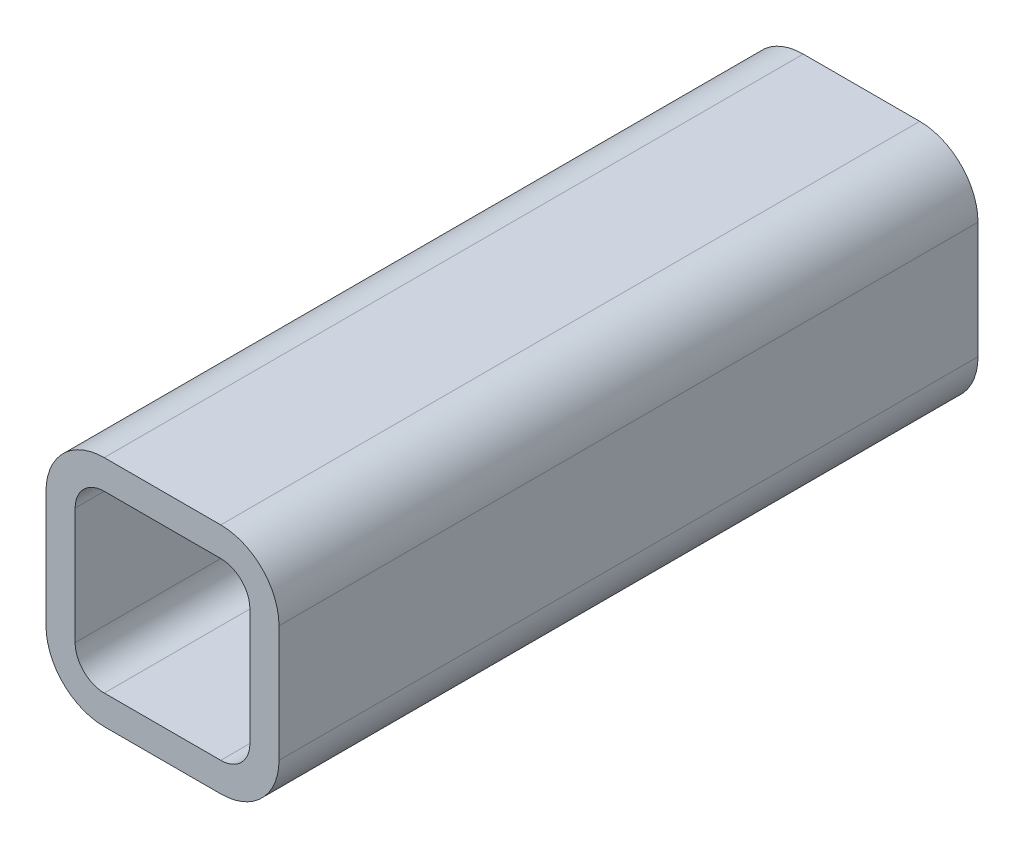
ISO-10303-21;
HEADER;
FILE_DESCRIPTION(('STEP AP214'),'2;1');
FILE_NAME('part.step','',(''),(''),'','','');
FILE_SCHEMA(('AUTOMOTIVE_DESIGN { 1 0 10303 214 1 1 1 1 }'));
ENDSEC;
DATA;
#1=APPLICATION_CONTEXT('core data for automotive mechanical design processes');
#2=APPLICATION_PROTOCOL_DEFINITION('international standard','automotive_design',2000,#1);
#3=PRODUCT_CONTEXT('',#1,'mechanical');
#4=PRODUCT('Part','Part','',(#3));
#5=PRODUCT_RELATED_PRODUCT_CATEGORY('part','',(#4));
#6=PRODUCT_DEFINITION_FORMATION('','',#4);
#7=PRODUCT_DEFINITION_CONTEXT('part definition',#1,'design');
#8=PRODUCT_DEFINITION('design','',#6,#7);
#9=PRODUCT_DEFINITION_SHAPE('','',#8);
#10=(LENGTH_UNIT() NAMED_UNIT(*) SI_UNIT(.MILLI.,.METRE.));
#11=(NAMED_UNIT(*) PLANE_ANGLE_UNIT() SI_UNIT($,.RADIAN.));
#12=(NAMED_UNIT(*) SI_UNIT($,.STERADIAN.) SOLID_ANGLE_UNIT());
#13=UNCERTAINTY_MEASURE_WITH_UNIT(LENGTH_MEASURE(1.E-05),#10,'distance_accuracy_value','');
#14=(GEOMETRIC_REPRESENTATION_CONTEXT(3) GLOBAL_UNCERTAINTY_ASSIGNED_CONTEXT((#13)) GLOBAL_UNIT_ASSIGNED_CONTEXT((#10,
#11,#12)) REPRESENTATION_CONTEXT('',''));
#15=CARTESIAN_POINT('',(0.,0.,0.));
#16=DIRECTION('',(0.,0.,1.));
#17=DIRECTION('',(1.,0.,0.));
#18=AXIS2_PLACEMENT_3D('',#15,#16,#17);
#19=CARTESIAN_POINT('',(27.0751778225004,78.2577651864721,304.8));
#20=DIRECTION('',(0.,0.,1.));
#21=DIRECTION('',(1.,0.,0.));
#22=AXIS2_PLACEMENT_3D('',#19,#20,#21);
#23=PLANE('',#22);
#24=CARTESIAN_POINT('',(27.0751778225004,78.2577651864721,304.8));
#25=DIRECTION('',(0.,0.,1.));
#26=DIRECTION('',(1.,0.,0.));
#27=AXIS2_PLACEMENT_3D('',#24,#25,#26);
#28=CIRCLE('',#27,25.4);
#29=CARTESIAN_POINT('',(27.0751778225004,103.657765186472,304.8));
#30=VERTEX_POINT('',#29);
#31=CARTESIAN_POINT('',(1.67517782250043,78.2577651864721,304.8));
#32=VERTEX_POINT('',#31);
#33=EDGE_CURVE('E211',#30,#32,#28,.T.);
#34=ORIENTED_EDGE('',*,*,#33,.T.);
#35=DIRECTION('',(0.,-1.,0.));
#36=VECTOR('',#35,1.);
#37=CARTESIAN_POINT('',(1.67517782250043,78.2577651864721,304.8));
#38=LINE('',#37,#36);
#39=CARTESIAN_POINT('',(1.67517782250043,27.4577651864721,304.8));
#40=VERTEX_POINT('',#39);
#41=EDGE_CURVE('E214',#32,#40,#38,.T.);
#42=ORIENTED_EDGE('',*,*,#41,.T.);
#43=CARTESIAN_POINT('',(27.0751778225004,27.4577651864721,304.8));
#44=DIRECTION('',(0.,0.,1.));
#45=DIRECTION('',(1.,0.,0.));
#46=AXIS2_PLACEMENT_3D('',#43,#44,#45);
#47=CIRCLE('',#46,25.4);
#48=CARTESIAN_POINT('',(27.0751778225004,2.05776518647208,304.8));
#49=VERTEX_POINT('',#48);
#50=EDGE_CURVE('E217',#40,#49,#47,.T.);
#51=ORIENTED_EDGE('',*,*,#50,.T.);
#52=DIRECTION('',(1.,0.,0.));
#53=VECTOR('',#52,1.);
#54=CARTESIAN_POINT('',(27.0751778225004,2.05776518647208,304.8));
#55=LINE('',#54,#53);
#56=CARTESIAN_POINT('',(77.8751778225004,2.05776518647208,304.8));
#57=VERTEX_POINT('',#56);
#58=EDGE_CURVE('E219',#49,#57,#55,.T.);
#59=ORIENTED_EDGE('',*,*,#58,.T.);
#60=CARTESIAN_POINT('',(77.8751778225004,27.4577651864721,304.8));
#61=DIRECTION('',(0.,0.,1.));
#62=DIRECTION('',(1.,0.,0.));
#63=AXIS2_PLACEMENT_3D('',#60,#61,#62);
#64=CIRCLE('',#63,25.4);
#65=CARTESIAN_POINT('',(103.2751778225,27.4577651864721,304.8));
#66=VERTEX_POINT('',#65);
#67=EDGE_CURVE('E221',#57,#66,#64,.T.);
#68=ORIENTED_EDGE('',*,*,#67,.T.);
#69=DIRECTION('',(0.,1.,0.));
#70=VECTOR('',#69,1.);
#71=CARTESIAN_POINT('',(103.2751778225,27.4577651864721,304.8));
#72=LINE('',#71,#70);
#73=CARTESIAN_POINT('',(103.2751778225,78.2577651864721,304.8));
#74=VERTEX_POINT('',#73);
#75=EDGE_CURVE('E223',#66,#74,#72,.T.);
#76=ORIENTED_EDGE('',*,*,#75,.T.);
#77=CARTESIAN_POINT('',(77.8751778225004,78.2577651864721,304.8));
#78=DIRECTION('',(0.,0.,1.));
#79=DIRECTION('',(1.,0.,0.));
#80=AXIS2_PLACEMENT_3D('',#77,#78,#79);
#81=CIRCLE('',#80,25.4);
#82=CARTESIAN_POINT('',(77.8751778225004,103.657765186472,304.8));
#83=VERTEX_POINT('',#82);
#84=EDGE_CURVE('E225',#74,#83,#81,.T.);
#85=ORIENTED_EDGE('',*,*,#84,.T.);
#86=DIRECTION('',(-1.,0.,0.));
#87=VECTOR('',#86,1.);
#88=CARTESIAN_POINT('',(77.8751778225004,103.657765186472,304.8));
#89=LINE('',#88,#87);
#90=EDGE_CURVE('E227',#83,#30,#89,.T.);
#91=ORIENTED_EDGE('',*,*,#90,.T.);
#92=EDGE_LOOP('',(#34,#42,#51,#59,#68,#76,#85,#91));
#93=FACE_BOUND('',#92,.T.);
#94=DIRECTION('',(0.,-1.,0.));
#95=VECTOR('',#94,1.);
#96=CARTESIAN_POINT('',(14.3751778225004,27.4577651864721,304.8));
#97=LINE('',#96,#95);
#98=CARTESIAN_POINT('',(14.3751778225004,78.2577651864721,304.8));
#99=VERTEX_POINT('',#98);
#100=CARTESIAN_POINT('',(14.3751778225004,27.4577651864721,304.8));
#101=VERTEX_POINT('',#100);
#102=EDGE_CURVE('E154',#99,#101,#97,.T.);
#103=ORIENTED_EDGE('',*,*,#102,.F.);
#104=CARTESIAN_POINT('',(27.0751778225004,78.2577651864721,304.8));
#105=DIRECTION('',(0.,0.,1.));
#106=DIRECTION('',(1.,0.,0.));
#107=AXIS2_PLACEMENT_3D('',#104,#105,#106);
#108=CIRCLE('',#107,12.7);
#109=CARTESIAN_POINT('',(27.0751778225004,90.9577651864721,304.8));
#110=VERTEX_POINT('',#109);
#111=EDGE_CURVE('E146',#110,#99,#108,.T.);
#112=ORIENTED_EDGE('',*,*,#111,.F.);
#113=DIRECTION('',(-1.,0.,0.));
#114=VECTOR('',#113,1.);
#115=CARTESIAN_POINT('',(27.0751778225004,90.9577651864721,304.8));
#116=LINE('',#115,#114);
#117=CARTESIAN_POINT('',(77.8751778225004,90.9577651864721,304.8));
#118=VERTEX_POINT('',#117);
#119=EDGE_CURVE('E179',#118,#110,#116,.T.);
#120=ORIENTED_EDGE('',*,*,#119,.F.);
#121=CARTESIAN_POINT('',(77.8751778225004,78.2577651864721,304.8));
#122=DIRECTION('',(0.,0.,1.));
#123=DIRECTION('',(1.,0.,0.));
#124=AXIS2_PLACEMENT_3D('',#121,#122,#123);
#125=CIRCLE('',#124,12.7);
#126=CARTESIAN_POINT('',(90.5751778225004,78.2577651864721,304.8));
#127=VERTEX_POINT('',#126);
#128=EDGE_CURVE('E177',#127,#118,#125,.T.);
#129=ORIENTED_EDGE('',*,*,#128,.F.);
#130=DIRECTION('',(0.,1.,0.));
#131=VECTOR('',#130,1.);
#132=CARTESIAN_POINT('',(90.5751778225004,78.2577651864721,304.8));
#133=LINE('',#132,#131);
#134=CARTESIAN_POINT('',(90.5751778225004,27.4577651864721,304.8));
#135=VERTEX_POINT('',#134);
#136=EDGE_CURVE('E175',#135,#127,#133,.T.);
#137=ORIENTED_EDGE('',*,*,#136,.F.);
#138=CARTESIAN_POINT('',(77.8751778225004,27.4577651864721,304.8));
#139=DIRECTION('',(0.,0.,1.));
#140=DIRECTION('',(1.,0.,0.));
#141=AXIS2_PLACEMENT_3D('',#138,#139,#140);
#142=CIRCLE('',#141,12.7);
#143=CARTESIAN_POINT('',(77.8751778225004,14.7577651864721,304.8));
#144=VERTEX_POINT('',#143);
#145=EDGE_CURVE('E173',#144,#135,#142,.T.);
#146=ORIENTED_EDGE('',*,*,#145,.F.);
#147=DIRECTION('',(1.,0.,0.));
#148=VECTOR('',#147,1.);
#149=CARTESIAN_POINT('',(77.8751778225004,14.7577651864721,304.8));
#150=LINE('',#149,#148);
#151=CARTESIAN_POINT('',(27.0751778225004,14.7577651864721,304.8));
#152=VERTEX_POINT('',#151);
#153=EDGE_CURVE('E169',#152,#144,#150,.T.);
#154=ORIENTED_EDGE('',*,*,#153,.F.);
#155=CARTESIAN_POINT('',(27.0751778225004,27.4577651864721,304.8));
#156=DIRECTION('',(0.,0.,1.));
#157=DIRECTION('',(1.,0.,0.));
#158=AXIS2_PLACEMENT_3D('',#155,#156,#157);
#159=CIRCLE('',#158,12.7);
#160=EDGE_CURVE('E167',#101,#152,#159,.T.);
#161=ORIENTED_EDGE('',*,*,#160,.F.);
#162=EDGE_LOOP('',(#103,#112,#120,#129,#137,#146,#154,#161));
#163=FACE_BOUND('',#162,.T.);
#164=ADVANCED_FACE('F33',(#93,#163),#23,.T.);
#165=CARTESIAN_POINT('',(27.0751778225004,78.2577651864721,0.));
#166=DIRECTION('',(0.,0.,1.));
#167=DIRECTION('',(1.,0.,0.));
#168=AXIS2_PLACEMENT_3D('',#165,#166,#167);
#169=PLANE('',#168);
#170=CARTESIAN_POINT('',(27.0751778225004,78.2577651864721,0.));
#171=DIRECTION('',(0.,0.,1.));
#172=DIRECTION('',(1.,0.,0.));
#173=AXIS2_PLACEMENT_3D('',#170,#171,#172);
#174=CIRCLE('',#173,25.4);
#175=CARTESIAN_POINT('',(27.0751778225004,103.657765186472,0.));
#176=VERTEX_POINT('',#175);
#177=CARTESIAN_POINT('',(1.67517782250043,78.2577651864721,0.));
#178=VERTEX_POINT('',#177);
#179=EDGE_CURVE('E162',#176,#178,#174,.T.);
#180=ORIENTED_EDGE('',*,*,#179,.F.);
#181=DIRECTION('',(-1.,0.,0.));
#182=VECTOR('',#181,1.);
#183=CARTESIAN_POINT('',(77.8751778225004,103.657765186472,0.));
#184=LINE('',#183,#182);
#185=CARTESIAN_POINT('',(77.8751778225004,103.657765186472,0.));
#186=VERTEX_POINT('',#185);
#187=EDGE_CURVE('E215',#186,#176,#184,.T.);
#188=ORIENTED_EDGE('',*,*,#187,.F.);
#189=CARTESIAN_POINT('',(77.8751778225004,78.2577651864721,0.));
#190=DIRECTION('',(0.,0.,1.));
#191=DIRECTION('',(1.,0.,0.));
#192=AXIS2_PLACEMENT_3D('',#189,#190,#191);
#193=CIRCLE('',#192,25.4);
#194=CARTESIAN_POINT('',(103.2751778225,78.2577651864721,0.));
#195=VERTEX_POINT('',#194);
#196=EDGE_CURVE('E242',#195,#186,#193,.T.);
#197=ORIENTED_EDGE('',*,*,#196,.F.);
#198=DIRECTION('',(0.,1.,0.));
#199=VECTOR('',#198,1.);
#200=CARTESIAN_POINT('',(103.2751778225,27.4577651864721,0.));
#201=LINE('',#200,#199);
#202=CARTESIAN_POINT('',(103.2751778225,27.4577651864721,0.));
#203=VERTEX_POINT('',#202);
#204=EDGE_CURVE('E240',#203,#195,#201,.T.);
#205=ORIENTED_EDGE('',*,*,#204,.F.);
#206=CARTESIAN_POINT('',(77.8751778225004,27.4577651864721,0.));
#207=DIRECTION('',(0.,0.,1.));
#208=DIRECTION('',(1.,0.,0.));
#209=AXIS2_PLACEMENT_3D('',#206,#207,#208);
#210=CIRCLE('',#209,25.4);
#211=CARTESIAN_POINT('',(77.8751778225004,2.05776518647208,0.));
#212=VERTEX_POINT('',#211);
#213=EDGE_CURVE('E238',#212,#203,#210,.T.);
#214=ORIENTED_EDGE('',*,*,#213,.F.);
#215=DIRECTION('',(1.,0.,0.));
#216=VECTOR('',#215,1.);
#217=CARTESIAN_POINT('',(27.0751778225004,2.05776518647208,0.));
#218=LINE('',#217,#216);
#219=CARTESIAN_POINT('',(27.0751778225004,2.05776518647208,0.));
#220=VERTEX_POINT('',#219);
#221=EDGE_CURVE('E236',#220,#212,#218,.T.);
#222=ORIENTED_EDGE('',*,*,#221,.F.);
#223=CARTESIAN_POINT('',(27.0751778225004,27.4577651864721,0.));
#224=DIRECTION('',(0.,0.,1.));
#225=DIRECTION('',(1.,0.,0.));
#226=AXIS2_PLACEMENT_3D('',#223,#224,#225);
#227=CIRCLE('',#226,25.4);
#228=CARTESIAN_POINT('',(1.67517782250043,27.4577651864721,0.));
#229=VERTEX_POINT('',#228);
#230=EDGE_CURVE('E234',#229,#220,#227,.T.);
#231=ORIENTED_EDGE('',*,*,#230,.F.);
#232=DIRECTION('',(0.,-1.,0.));
#233=VECTOR('',#232,1.);
#234=CARTESIAN_POINT('',(1.67517782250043,78.2577651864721,0.));
#235=LINE('',#234,#233);
#236=EDGE_CURVE('E232',#178,#229,#235,.T.);
#237=ORIENTED_EDGE('',*,*,#236,.F.);
#238=EDGE_LOOP('',(#180,#188,#197,#205,#214,#222,#231,#237));
#239=FACE_BOUND('',#238,.T.);
#240=CARTESIAN_POINT('',(27.0751778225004,78.2577651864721,0.));
#241=DIRECTION('',(0.,0.,1.));
#242=DIRECTION('',(1.,0.,0.));
#243=AXIS2_PLACEMENT_3D('',#240,#241,#242);
#244=CIRCLE('',#243,12.7);
#245=CARTESIAN_POINT('',(27.0751778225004,90.9577651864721,0.));
#246=VERTEX_POINT('',#245);
#247=CARTESIAN_POINT('',(14.3751778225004,78.2577651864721,0.));
#248=VERTEX_POINT('',#247);
#249=EDGE_CURVE('E56',#246,#248,#244,.T.);
#250=ORIENTED_EDGE('',*,*,#249,.T.);
#251=DIRECTION('',(0.,-1.,0.));
#252=VECTOR('',#251,1.);
#253=CARTESIAN_POINT('',(14.3751778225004,27.4577651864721,0.));
#254=LINE('',#253,#252);
#255=CARTESIAN_POINT('',(14.3751778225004,27.4577651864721,0.));
#256=VERTEX_POINT('',#255);
#257=EDGE_CURVE('E161',#248,#256,#254,.T.);
#258=ORIENTED_EDGE('',*,*,#257,.T.);
#259=CARTESIAN_POINT('',(27.0751778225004,27.4577651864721,0.));
#260=DIRECTION('',(0.,0.,1.));
#261=DIRECTION('',(1.,0.,0.));
#262=AXIS2_PLACEMENT_3D('',#259,#260,#261);
#263=CIRCLE('',#262,12.7);
#264=CARTESIAN_POINT('',(27.0751778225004,14.7577651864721,0.));
#265=VERTEX_POINT('',#264);
#266=EDGE_CURVE('E183',#256,#265,#263,.T.);
#267=ORIENTED_EDGE('',*,*,#266,.T.);
#268=DIRECTION('',(1.,0.,0.));
#269=VECTOR('',#268,1.);
#270=CARTESIAN_POINT('',(77.8751778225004,14.7577651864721,0.));
#271=LINE('',#270,#269);
#272=CARTESIAN_POINT('',(77.8751778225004,14.7577651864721,0.));
#273=VERTEX_POINT('',#272);
#274=EDGE_CURVE('E186',#265,#273,#271,.T.);
#275=ORIENTED_EDGE('',*,*,#274,.T.);
#276=CARTESIAN_POINT('',(77.8751778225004,27.4577651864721,0.));
#277=DIRECTION('',(0.,0.,1.));
#278=DIRECTION('',(1.,0.,0.));
#279=AXIS2_PLACEMENT_3D('',#276,#277,#278);
#280=CIRCLE('',#279,12.7);
#281=CARTESIAN_POINT('',(90.5751778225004,27.4577651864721,0.));
#282=VERTEX_POINT('',#281);
#283=EDGE_CURVE('E189',#273,#282,#280,.T.);
#284=ORIENTED_EDGE('',*,*,#283,.T.);
#285=DIRECTION('',(0.,1.,0.));
#286=VECTOR('',#285,1.);
#287=CARTESIAN_POINT('',(90.5751778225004,78.2577651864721,0.));
#288=LINE('',#287,#286);
#289=CARTESIAN_POINT('',(90.5751778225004,78.2577651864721,0.));
#290=VERTEX_POINT('',#289);
#291=EDGE_CURVE('E192',#282,#290,#288,.T.);
#292=ORIENTED_EDGE('',*,*,#291,.T.);
#293=CARTESIAN_POINT('',(77.8751778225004,78.2577651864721,0.));
#294=DIRECTION('',(0.,0.,1.));
#295=DIRECTION('',(1.,0.,0.));
#296=AXIS2_PLACEMENT_3D('',#293,#294,#295);
#297=CIRCLE('',#296,12.7);
#298=CARTESIAN_POINT('',(77.8751778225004,90.9577651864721,0.));
#299=VERTEX_POINT('',#298);
#300=EDGE_CURVE('E195',#290,#299,#297,.T.);
#301=ORIENTED_EDGE('',*,*,#300,.T.);
#302=DIRECTION('',(-1.,0.,0.));
#303=VECTOR('',#302,1.);
#304=CARTESIAN_POINT('',(27.0751778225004,90.9577651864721,0.));
#305=LINE('',#304,#303);
#306=EDGE_CURVE('E155',#299,#246,#305,.T.);
#307=ORIENTED_EDGE('',*,*,#306,.T.);
#308=EDGE_LOOP('',(#250,#258,#267,#275,#284,#292,#301,#307));
#309=FACE_BOUND('',#308,.T.);
#310=ADVANCED_FACE('F272',(#239,#309),#169,.F.);
#311=CARTESIAN_POINT('',(27.0751778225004,78.2577651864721,304.8));
#312=DIRECTION('',(0.,0.,-1.));
#313=DIRECTION('',(-1.,0.,0.));
#314=AXIS2_PLACEMENT_3D('',#311,#312,#313);
#315=CYLINDRICAL_SURFACE('',#314,25.4);
#316=ORIENTED_EDGE('',*,*,#179,.T.);
#317=DIRECTION('',(0.,0.,-1.));
#318=VECTOR('',#317,1.);
#319=CARTESIAN_POINT('',(1.67517782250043,78.2577651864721,304.8));
#320=LINE('',#319,#318);
#321=EDGE_CURVE('E11',#32,#178,#320,.T.);
#322=ORIENTED_EDGE('',*,*,#321,.F.);
#323=ORIENTED_EDGE('',*,*,#33,.F.);
#324=DIRECTION('',(0.,0.,-1.));
#325=VECTOR('',#324,1.);
#326=CARTESIAN_POINT('',(27.0751778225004,103.657765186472,304.8));
#327=LINE('',#326,#325);
#328=EDGE_CURVE('E229',#30,#176,#327,.T.);
#329=ORIENTED_EDGE('',*,*,#328,.T.);
#330=EDGE_LOOP('',(#316,#322,#323,#329));
#331=FACE_BOUND('',#330,.T.);
#332=ADVANCED_FACE('F35',(#331),#315,.T.);
#333=CARTESIAN_POINT('',(1.67517782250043,78.2577651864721,304.8));
#334=DIRECTION('',(1.,0.,0.));
#335=DIRECTION('',(0.,0.,-1.));
#336=AXIS2_PLACEMENT_3D('',#333,#334,#335);
#337=PLANE('',#336);
#338=ORIENTED_EDGE('',*,*,#236,.T.);
#339=DIRECTION('',(0.,0.,-1.));
#340=VECTOR('',#339,1.);
#341=CARTESIAN_POINT('',(1.67517782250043,27.4577651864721,304.8));
#342=LINE('',#341,#340);
#343=EDGE_CURVE('E41',#40,#229,#342,.T.);
#344=ORIENTED_EDGE('',*,*,#343,.F.);
#345=ORIENTED_EDGE('',*,*,#41,.F.);
#346=ORIENTED_EDGE('',*,*,#321,.T.);
#347=EDGE_LOOP('',(#338,#344,#345,#346));
#348=FACE_BOUND('',#347,.T.);
#349=ADVANCED_FACE('F289',(#348),#337,.F.);
#350=CARTESIAN_POINT('',(27.0751778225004,27.4577651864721,304.8));
#351=DIRECTION('',(0.,0.,-1.));
#352=DIRECTION('',(-1.,0.,0.));
#353=AXIS2_PLACEMENT_3D('',#350,#351,#352);
#354=CYLINDRICAL_SURFACE('',#353,25.4);
#355=ORIENTED_EDGE('',*,*,#230,.T.);
#356=DIRECTION('',(0.,0.,-1.));
#357=VECTOR('',#356,1.);
#358=CARTESIAN_POINT('',(27.0751778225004,2.05776518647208,304.8));
#359=LINE('',#358,#357);
#360=EDGE_CURVE('E259',#49,#220,#359,.T.);
#361=ORIENTED_EDGE('',*,*,#360,.F.);
#362=ORIENTED_EDGE('',*,*,#50,.F.);
#363=ORIENTED_EDGE('',*,*,#343,.T.);
#364=EDGE_LOOP('',(#355,#361,#362,#363));
#365=FACE_BOUND('',#364,.T.);
#366=ADVANCED_FACE('F266',(#365),#354,.T.);
#367=CARTESIAN_POINT('',(27.0751778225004,2.05776518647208,304.8));
#368=DIRECTION('',(0.,1.,0.));
#369=DIRECTION('',(0.,0.,1.));
#370=AXIS2_PLACEMENT_3D('',#367,#368,#369);
#371=PLANE('',#370);
#372=ORIENTED_EDGE('',*,*,#221,.T.);
#373=DIRECTION('',(0.,0.,-1.));
#374=VECTOR('',#373,1.);
#375=CARTESIAN_POINT('',(77.8751778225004,2.05776518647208,304.8));
#376=LINE('',#375,#374);
#377=EDGE_CURVE('E256',#57,#212,#376,.T.);
#378=ORIENTED_EDGE('',*,*,#377,.F.);
#379=ORIENTED_EDGE('',*,*,#58,.F.);
#380=ORIENTED_EDGE('',*,*,#360,.T.);
#381=EDGE_LOOP('',(#372,#378,#379,#380));
#382=FACE_BOUND('',#381,.T.);
#383=ADVANCED_FACE('F278',(#382),#371,.F.);
#384=CARTESIAN_POINT('',(77.8751778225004,27.4577651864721,304.8));
#385=DIRECTION('',(0.,0.,-1.));
#386=DIRECTION('',(-1.,0.,0.));
#387=AXIS2_PLACEMENT_3D('',#384,#385,#386);
#388=CYLINDRICAL_SURFACE('',#387,25.4);
#389=ORIENTED_EDGE('',*,*,#213,.T.);
#390=DIRECTION('',(0.,0.,-1.));
#391=VECTOR('',#390,1.);
#392=CARTESIAN_POINT('',(103.2751778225,27.4577651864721,304.8));
#393=LINE('',#392,#391);
#394=EDGE_CURVE('E253',#66,#203,#393,.T.);
#395=ORIENTED_EDGE('',*,*,#394,.F.);
#396=ORIENTED_EDGE('',*,*,#67,.F.);
#397=ORIENTED_EDGE('',*,*,#377,.T.);
#398=EDGE_LOOP('',(#389,#395,#396,#397));
#399=FACE_BOUND('',#398,.T.);
#400=ADVANCED_FACE('F282',(#399),#388,.T.);
#401=CARTESIAN_POINT('',(103.2751778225,27.4577651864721,304.8));
#402=DIRECTION('',(-1.,0.,0.));
#403=DIRECTION('',(0.,0.,1.));
#404=AXIS2_PLACEMENT_3D('',#401,#402,#403);
#405=PLANE('',#404);
#406=ORIENTED_EDGE('',*,*,#204,.T.);
#407=DIRECTION('',(0.,0.,-1.));
#408=VECTOR('',#407,1.);
#409=CARTESIAN_POINT('',(103.2751778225,78.2577651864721,304.8));
#410=LINE('',#409,#408);
#411=EDGE_CURVE('E250',#74,#195,#410,.T.);
#412=ORIENTED_EDGE('',*,*,#411,.F.);
#413=ORIENTED_EDGE('',*,*,#75,.F.);
#414=ORIENTED_EDGE('',*,*,#394,.T.);
#415=EDGE_LOOP('',(#406,#412,#413,#414));
#416=FACE_BOUND('',#415,.T.);
#417=ADVANCED_FACE('F302',(#416),#405,.F.);
#418=CARTESIAN_POINT('',(77.8751778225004,78.2577651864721,304.8));
#419=DIRECTION('',(0.,0.,-1.));
#420=DIRECTION('',(-1.,0.,0.));
#421=AXIS2_PLACEMENT_3D('',#418,#419,#420);
#422=CYLINDRICAL_SURFACE('',#421,25.4);
#423=ORIENTED_EDGE('',*,*,#196,.T.);
#424=DIRECTION('',(0.,0.,-1.));
#425=VECTOR('',#424,1.);
#426=CARTESIAN_POINT('',(77.8751778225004,103.657765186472,304.8));
#427=LINE('',#426,#425);
#428=EDGE_CURVE('E247',#83,#186,#427,.T.);
#429=ORIENTED_EDGE('',*,*,#428,.F.);
#430=ORIENTED_EDGE('',*,*,#84,.F.);
#431=ORIENTED_EDGE('',*,*,#411,.T.);
#432=EDGE_LOOP('',(#423,#429,#430,#431));
#433=FACE_BOUND('',#432,.T.);
#434=ADVANCED_FACE('F300',(#433),#422,.T.);
#435=CARTESIAN_POINT('',(77.8751778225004,103.657765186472,304.8));
#436=DIRECTION('',(0.,-1.,0.));
#437=DIRECTION('',(0.,0.,-1.));
#438=AXIS2_PLACEMENT_3D('',#435,#436,#437);
#439=PLANE('',#438);
#440=ORIENTED_EDGE('',*,*,#187,.T.);
#441=ORIENTED_EDGE('',*,*,#328,.F.);
#442=ORIENTED_EDGE('',*,*,#90,.F.);
#443=ORIENTED_EDGE('',*,*,#428,.T.);
#444=EDGE_LOOP('',(#440,#441,#442,#443));
#445=FACE_BOUND('',#444,.T.);
#446=ADVANCED_FACE('F295',(#445),#439,.F.);
#447=CARTESIAN_POINT('',(27.0751778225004,78.2577651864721,304.8));
#448=DIRECTION('',(0.,0.,-1.));
#449=DIRECTION('',(-1.,0.,0.));
#450=AXIS2_PLACEMENT_3D('',#447,#448,#449);
#451=CYLINDRICAL_SURFACE('',#450,12.7);
#452=ORIENTED_EDGE('',*,*,#249,.F.);
#453=DIRECTION('',(0.,0.,-1.));
#454=VECTOR('',#453,1.);
#455=CARTESIAN_POINT('',(27.0751778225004,90.9577651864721,304.8));
#456=LINE('',#455,#454);
#457=EDGE_CURVE('E150',#110,#246,#456,.T.);
#458=ORIENTED_EDGE('',*,*,#457,.F.);
#459=ORIENTED_EDGE('',*,*,#111,.T.);
#460=DIRECTION('',(0.,0.,-1.));
#461=VECTOR('',#460,1.);
#462=CARTESIAN_POINT('',(14.3751778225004,78.2577651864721,304.8));
#463=LINE('',#462,#461);
#464=EDGE_CURVE('E149',#99,#248,#463,.T.);
#465=ORIENTED_EDGE('',*,*,#464,.T.);
#466=EDGE_LOOP('',(#452,#458,#459,#465));
#467=FACE_BOUND('',#466,.T.);
#468=ADVANCED_FACE('F148',(#467),#451,.F.);
#469=CARTESIAN_POINT('',(14.3751778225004,27.4577651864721,304.8));
#470=DIRECTION('',(1.,0.,0.));
#471=DIRECTION('',(0.,0.,-1.));
#472=AXIS2_PLACEMENT_3D('',#469,#470,#471);
#473=PLANE('',#472);
#474=ORIENTED_EDGE('',*,*,#257,.F.);
#475=ORIENTED_EDGE('',*,*,#464,.F.);
#476=ORIENTED_EDGE('',*,*,#102,.T.);
#477=DIRECTION('',(0.,0.,-1.));
#478=VECTOR('',#477,1.);
#479=CARTESIAN_POINT('',(14.3751778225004,27.4577651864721,304.8));
#480=LINE('',#479,#478);
#481=EDGE_CURVE('E163',#101,#256,#480,.T.);
#482=ORIENTED_EDGE('',*,*,#481,.T.);
#483=EDGE_LOOP('',(#474,#475,#476,#482));
#484=FACE_BOUND('',#483,.T.);
#485=ADVANCED_FACE('F158',(#484),#473,.T.);
#486=CARTESIAN_POINT('',(27.0751778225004,27.4577651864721,304.8));
#487=DIRECTION('',(0.,0.,-1.));
#488=DIRECTION('',(-1.,0.,0.));
#489=AXIS2_PLACEMENT_3D('',#486,#487,#488);
#490=CYLINDRICAL_SURFACE('',#489,12.7);
#491=ORIENTED_EDGE('',*,*,#266,.F.);
#492=ORIENTED_EDGE('',*,*,#481,.F.);
#493=ORIENTED_EDGE('',*,*,#160,.T.);
#494=DIRECTION('',(0.,0.,-1.));
#495=VECTOR('',#494,1.);
#496=CARTESIAN_POINT('',(27.0751778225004,14.7577651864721,304.8));
#497=LINE('',#496,#495);
#498=EDGE_CURVE('E208',#152,#265,#497,.T.);
#499=ORIENTED_EDGE('',*,*,#498,.T.);
#500=EDGE_LOOP('',(#491,#492,#493,#499));
#501=FACE_BOUND('',#500,.T.);
#502=ADVANCED_FACE('F327',(#501),#490,.F.);
#503=CARTESIAN_POINT('',(77.8751778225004,14.7577651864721,304.8));
#504=DIRECTION('',(0.,1.,0.));
#505=DIRECTION('',(0.,0.,1.));
#506=AXIS2_PLACEMENT_3D('',#503,#504,#505);
#507=PLANE('',#506);
#508=ORIENTED_EDGE('',*,*,#274,.F.);
#509=ORIENTED_EDGE('',*,*,#498,.F.);
#510=ORIENTED_EDGE('',*,*,#153,.T.);
#511=DIRECTION('',(0.,0.,-1.));
#512=VECTOR('',#511,1.);
#513=CARTESIAN_POINT('',(77.8751778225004,14.7577651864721,304.8));
#514=LINE('',#513,#512);
#515=EDGE_CURVE('E206',#144,#273,#514,.T.);
#516=ORIENTED_EDGE('',*,*,#515,.T.);
#517=EDGE_LOOP('',(#508,#509,#510,#516));
#518=FACE_BOUND('',#517,.T.);
#519=ADVANCED_FACE('F331',(#518),#507,.T.);
#520=CARTESIAN_POINT('',(77.8751778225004,27.4577651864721,304.8));
#521=DIRECTION('',(0.,0.,-1.));
#522=DIRECTION('',(-1.,0.,0.));
#523=AXIS2_PLACEMENT_3D('',#520,#521,#522);
#524=CYLINDRICAL_SURFACE('',#523,12.7);
#525=ORIENTED_EDGE('',*,*,#283,.F.);
#526=ORIENTED_EDGE('',*,*,#515,.F.);
#527=ORIENTED_EDGE('',*,*,#145,.T.);
#528=DIRECTION('',(0.,0.,-1.));
#529=VECTOR('',#528,1.);
#530=CARTESIAN_POINT('',(90.5751778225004,27.4577651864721,304.8));
#531=LINE('',#530,#529);
#532=EDGE_CURVE('E204',#135,#282,#531,.T.);
#533=ORIENTED_EDGE('',*,*,#532,.T.);
#534=EDGE_LOOP('',(#525,#526,#527,#533));
#535=FACE_BOUND('',#534,.T.);
#536=ADVANCED_FACE('F337',(#535),#524,.F.);
#537=CARTESIAN_POINT('',(90.5751778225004,78.2577651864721,304.8));
#538=DIRECTION('',(-1.,0.,0.));
#539=DIRECTION('',(0.,0.,1.));
#540=AXIS2_PLACEMENT_3D('',#537,#538,#539);
#541=PLANE('',#540);
#542=ORIENTED_EDGE('',*,*,#291,.F.);
#543=ORIENTED_EDGE('',*,*,#532,.F.);
#544=ORIENTED_EDGE('',*,*,#136,.T.);
#545=DIRECTION('',(0.,0.,-1.));
#546=VECTOR('',#545,1.);
#547=CARTESIAN_POINT('',(90.5751778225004,78.2577651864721,304.8));
#548=LINE('',#547,#546);
#549=EDGE_CURVE('E202',#127,#290,#548,.T.);
#550=ORIENTED_EDGE('',*,*,#549,.T.);
#551=EDGE_LOOP('',(#542,#543,#544,#550));
#552=FACE_BOUND('',#551,.T.);
#553=ADVANCED_FACE('F341',(#552),#541,.T.);
#554=CARTESIAN_POINT('',(77.8751778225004,78.2577651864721,304.8));
#555=DIRECTION('',(0.,0.,-1.));
#556=DIRECTION('',(-1.,0.,0.));
#557=AXIS2_PLACEMENT_3D('',#554,#555,#556);
#558=CYLINDRICAL_SURFACE('',#557,12.7);
#559=ORIENTED_EDGE('',*,*,#300,.F.);
#560=ORIENTED_EDGE('',*,*,#549,.F.);
#561=ORIENTED_EDGE('',*,*,#128,.T.);
#562=DIRECTION('',(0.,0.,-1.));
#563=VECTOR('',#562,1.);
#564=CARTESIAN_POINT('',(77.8751778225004,90.9577651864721,304.8));
#565=LINE('',#564,#563);
#566=EDGE_CURVE('E48',#118,#299,#565,.T.);
#567=ORIENTED_EDGE('',*,*,#566,.T.);
#568=EDGE_LOOP('',(#559,#560,#561,#567));
#569=FACE_BOUND('',#568,.T.);
#570=ADVANCED_FACE('F345',(#569),#558,.F.);
#571=CARTESIAN_POINT('',(27.0751778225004,90.9577651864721,304.8));
#572=DIRECTION('',(0.,-1.,0.));
#573=DIRECTION('',(0.,0.,-1.));
#574=AXIS2_PLACEMENT_3D('',#571,#572,#573);
#575=PLANE('',#574);
#576=ORIENTED_EDGE('',*,*,#306,.F.);
#577=ORIENTED_EDGE('',*,*,#566,.F.);
#578=ORIENTED_EDGE('',*,*,#119,.T.);
#579=ORIENTED_EDGE('',*,*,#457,.T.);
#580=EDGE_LOOP('',(#576,#577,#578,#579));
#581=FACE_BOUND('',#580,.T.);
#582=ADVANCED_FACE('F349',(#581),#575,.T.);
#583=CLOSED_SHELL('',(#164,#310,#332,#349,#366,#383,#400,#417,#434,#446,#468,#485,#502,#519,
#536,#553,#570,#582));
#584=MANIFOLD_SOLID_BREP('B2',#583);
#585=ADVANCED_BREP_SHAPE_REPRESENTATION('',(#18,#584),#14);
#586=SHAPE_DEFINITION_REPRESENTATION(#9,#585);
ENDSEC;
END-ISO-10303-21;
